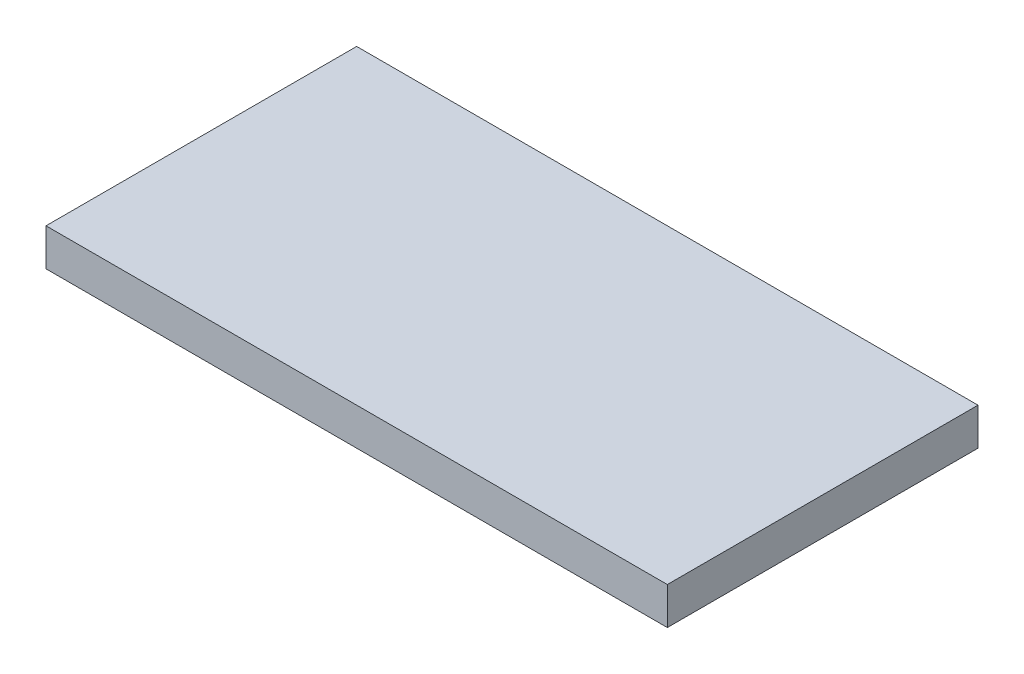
from build123d import *

# Parameters (mm, degrees)
SKETCH1_W      = 50
SKETCH1_H      = 25
EXTRUDE1_DEPTH = 3


with BuildPart() as part:
    # Sketch1 → Extrude1 (new body)
    with BuildSketch(Plane(origin=(0, 0, 0), x_dir=(1, 0, 0), z_dir=(0, 1, 0))):
        with Locations((25, 12.5)):
            Rectangle(SKETCH1_W, SKETCH1_H)
    extrude(amount=EXTRUDE1_DEPTH)


solid = part.part
